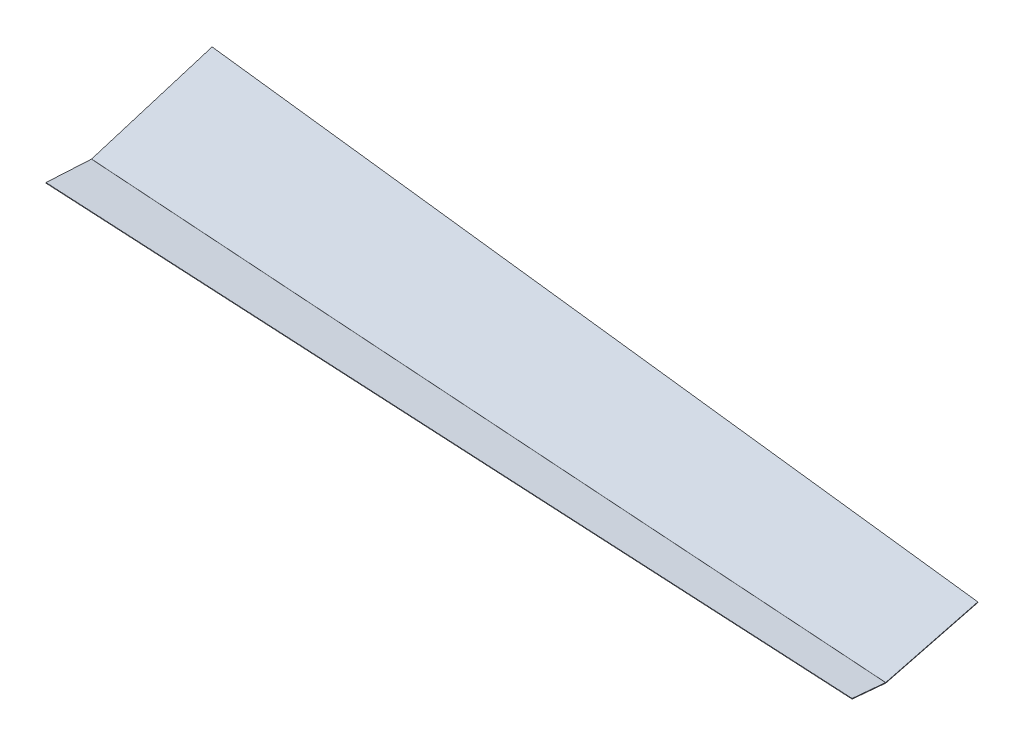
ISO-10303-21;
HEADER;
FILE_DESCRIPTION(('STEP AP214'),'2;1');
FILE_NAME('part.step','',(''),(''),'','','');
FILE_SCHEMA(('AUTOMOTIVE_DESIGN { 1 0 10303 214 1 1 1 1 }'));
ENDSEC;
DATA;
#1=APPLICATION_CONTEXT('core data for automotive mechanical design processes');
#2=APPLICATION_PROTOCOL_DEFINITION('international standard','automotive_design',2000,#1);
#3=PRODUCT_CONTEXT('',#1,'mechanical');
#4=PRODUCT('Part','Part','',(#3));
#5=PRODUCT_RELATED_PRODUCT_CATEGORY('part','',(#4));
#6=PRODUCT_DEFINITION_FORMATION('','',#4);
#7=PRODUCT_DEFINITION_CONTEXT('part definition',#1,'design');
#8=PRODUCT_DEFINITION('design','',#6,#7);
#9=PRODUCT_DEFINITION_SHAPE('','',#8);
#10=(LENGTH_UNIT() NAMED_UNIT(*) SI_UNIT(.MILLI.,.METRE.));
#11=(NAMED_UNIT(*) PLANE_ANGLE_UNIT() SI_UNIT($,.RADIAN.));
#12=(NAMED_UNIT(*) SI_UNIT($,.STERADIAN.) SOLID_ANGLE_UNIT());
#13=UNCERTAINTY_MEASURE_WITH_UNIT(LENGTH_MEASURE(1.E-05),#10,'distance_accuracy_value','');
#14=(GEOMETRIC_REPRESENTATION_CONTEXT(3) GLOBAL_UNCERTAINTY_ASSIGNED_CONTEXT((#13)) GLOBAL_UNIT_ASSIGNED_CONTEXT((#10,
#11,#12)) REPRESENTATION_CONTEXT('',''));
#15=CARTESIAN_POINT('',(0.,0.,0.));
#16=DIRECTION('',(0.,0.,1.));
#17=DIRECTION('',(1.,0.,0.));
#18=AXIS2_PLACEMENT_3D('',#15,#16,#17);
#19=CARTESIAN_POINT('',(78.2546476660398,-374.797848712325,-112.025459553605));
#20=DIRECTION('',(0.998748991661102,0.0206573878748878,0.0455381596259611));
#21=DIRECTION('',(0.0374881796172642,0.293352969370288,-0.955268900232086));
#22=AXIS2_PLACEMENT_3D('',#19,#20,#21);
#23=PLANE('',#22);
#24=DIRECTION('',(-0.0330921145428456,0.955780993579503,0.292211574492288));
#25=VECTOR('',#24,1.);
#26=CARTESIAN_POINT('',(108.26510912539,-139.959612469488,-876.748121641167));
#27=LINE('',#26,#25);
#28=CARTESIAN_POINT('',(108.318903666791,-141.513330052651,-877.223140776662));
#29=VERTEX_POINT('',#28);
#30=CARTESIAN_POINT('',(108.26510912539,-139.959612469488,-876.748121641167));
#31=VERTEX_POINT('',#30);
#32=EDGE_CURVE('E12',#29,#31,#27,.T.);
#33=ORIENTED_EDGE('',*,*,#32,.F.);
#34=DIRECTION('',(0.0374881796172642,0.293352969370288,-0.955268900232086));
#35=VECTOR('',#34,1.);
#36=CARTESIAN_POINT('',(78.3084422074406,-376.351566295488,-112.5004786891));
#37=LINE('',#36,#35);
#38=CARTESIAN_POINT('',(119.079163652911,-57.3120097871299,-1151.41468136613));
#39=VERTEX_POINT('',#38);
#40=EDGE_CURVE('E165',#29,#39,#37,.T.);
#41=ORIENTED_EDGE('',*,*,#40,.T.);
#42=DIRECTION('',(-0.0330921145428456,0.955780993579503,0.292211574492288));
#43=VECTOR('',#42,1.);
#44=CARTESIAN_POINT('',(119.02536911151,-55.7582922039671,-1150.93966223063));
#45=LINE('',#44,#43);
#46=CARTESIAN_POINT('',(119.02536911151,-55.7582922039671,-1150.93966223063));
#47=VERTEX_POINT('',#46);
#48=EDGE_CURVE('E125',#39,#47,#45,.T.);
#49=ORIENTED_EDGE('',*,*,#48,.T.);
#50=DIRECTION('',(0.0374881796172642,0.293352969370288,-0.955268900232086));
#51=VECTOR('',#50,1.);
#52=CARTESIAN_POINT('',(78.2546476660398,-374.797848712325,-112.025459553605));
#53=LINE('',#52,#51);
#54=EDGE_CURVE('E168',#31,#47,#53,.T.);
#55=ORIENTED_EDGE('',*,*,#54,.F.);
#56=EDGE_LOOP('',(#33,#41,#49,#55));
#57=FACE_BOUND('',#56,.T.);
#58=ADVANCED_FACE('F112',(#57),#23,.T.);
#59=CARTESIAN_POINT('',(144.297455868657,-55.758265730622,-1148.07775818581));
#60=DIRECTION('',(-0.107548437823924,-0.294079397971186,0.949710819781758));
#61=DIRECTION('',(0.993648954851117,1.0408800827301E-06,0.112524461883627));
#62=AXIS2_PLACEMENT_3D('',#59,#60,#61);
#63=PLANE('',#62);
#64=ORIENTED_EDGE('',*,*,#48,.F.);
#65=DIRECTION('',(0.993648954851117,1.0408800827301E-06,0.112524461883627));
#66=VECTOR('',#65,1.);
#67=CARTESIAN_POINT('',(144.351250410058,-57.3119833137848,-1148.5527773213));
#68=LINE('',#67,#66);
#69=CARTESIAN_POINT('',(-2552.6462054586,-57.3148085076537,-1453.97068768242));
#70=VERTEX_POINT('',#69);
#71=EDGE_CURVE('E194',#70,#39,#68,.T.);
#72=ORIENTED_EDGE('',*,*,#71,.F.);
#73=DIRECTION('',(-0.0330921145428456,0.955780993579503,0.292211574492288));
#74=VECTOR('',#73,1.);
#75=CARTESIAN_POINT('',(-2552.7,-55.7610909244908,-1453.49566854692));
#76=LINE('',#75,#74);
#77=CARTESIAN_POINT('',(-2552.7,-55.7610909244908,-1453.49566854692));
#78=VERTEX_POINT('',#77);
#79=EDGE_CURVE('E219',#70,#78,#76,.T.);
#80=ORIENTED_EDGE('',*,*,#79,.T.);
#81=DIRECTION('',(0.993648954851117,1.0408800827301E-06,0.112524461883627));
#82=VECTOR('',#81,1.);
#83=CARTESIAN_POINT('',(144.297455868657,-55.758265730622,-1148.07775818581));
#84=LINE('',#83,#82);
#85=EDGE_CURVE('E232',#78,#47,#84,.T.);
#86=ORIENTED_EDGE('',*,*,#85,.T.);
#87=EDGE_LOOP('',(#64,#72,#80,#86));
#88=FACE_BOUND('',#87,.T.);
#89=ADVANCED_FACE('F239',(#88),#63,.F.);
#90=CARTESIAN_POINT('',(-2552.7,-457.38679673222,-139.837177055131));
#91=DIRECTION('',(0.999452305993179,0.0316461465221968,0.00967519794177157));
#92=DIRECTION('',(0.,0.292371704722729,-0.956304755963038));
#93=AXIS2_PLACEMENT_3D('',#90,#91,#92);
#94=PLANE('',#93);
#95=ORIENTED_EDGE('',*,*,#79,.F.);
#96=DIRECTION('',(0.,-0.292371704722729,0.956304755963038));
#97=VECTOR('',#96,1.);
#98=CARTESIAN_POINT('',(-2552.6462054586,-458.940514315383,-140.312196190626));
#99=LINE('',#98,#97);
#100=CARTESIAN_POINT('',(-2552.6462054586,-171.288577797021,-1081.17928596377));
#101=VERTEX_POINT('',#100);
#102=EDGE_CURVE('E282',#101,#70,#99,.F.);
#103=ORIENTED_EDGE('',*,*,#102,.F.);
#104=DIRECTION('',(-0.0330921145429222,0.955780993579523,0.292211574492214));
#105=VECTOR('',#104,1.);
#106=CARTESIAN_POINT('',(-2552.7,-169.734860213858,-1080.70426682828));
#107=LINE('',#106,#105);
#108=CARTESIAN_POINT('',(-2552.7,-169.734860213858,-1080.70426682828));
#109=VERTEX_POINT('',#108);
#110=EDGE_CURVE('E215',#101,#109,#107,.T.);
#111=ORIENTED_EDGE('',*,*,#110,.T.);
#112=DIRECTION('',(0.,0.292371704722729,-0.956304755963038));
#113=VECTOR('',#112,1.);
#114=CARTESIAN_POINT('',(-2552.7,-457.38679673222,-139.837177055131));
#115=LINE('',#114,#113);
#116=EDGE_CURVE('E241',#109,#78,#115,.T.);
#117=ORIENTED_EDGE('',*,*,#116,.T.);
#118=EDGE_LOOP('',(#95,#103,#111,#117));
#119=FACE_BOUND('',#118,.T.);
#120=ADVANCED_FACE('F289',(#119),#94,.F.);
#121=CARTESIAN_POINT('',(-2552.57445724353,-168.650202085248,-1083.4422371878));
#122=CARTESIAN_POINT('',(-2552.61630482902,-168.572159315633,-1082.90765549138));
#123=CARTESIAN_POINT('',(-2552.65815241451,-168.494116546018,-1082.37307379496));
#124=CARTESIAN_POINT('',(-2552.7,-168.416073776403,-1081.83849209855));
#125=CARTESIAN_POINT('',(-2552.57445724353,-175.084398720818,-1082.50291859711));
#126=CARTESIAN_POINT('',(-2552.61630482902,-173.933989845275,-1082.12488999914));
#127=CARTESIAN_POINT('',(-2552.65815241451,-172.783580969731,-1081.74686140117));
#128=CARTESIAN_POINT('',(-2552.7,-171.633172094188,-1081.3688328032));
#129=CARTESIAN_POINT('',(-2552.82554275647,-174.145075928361,-1076.06869318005));
#130=CARTESIAN_POINT('',(-2552.78369517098,-173.150752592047,-1076.75982797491));
#131=CARTESIAN_POINT('',(-2552.74184758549,-172.156429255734,-1077.45096276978));
#132=CARTESIAN_POINT('',(-2552.7,-171.162105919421,-1078.14209756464));
#133=CARTESIAN_POINT('',(-2552.82554275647,-167.71087929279,-1077.00801177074));
#134=CARTESIAN_POINT('',(-2552.78369517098,-167.788922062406,-1077.54259346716));
#135=CARTESIAN_POINT('',(-2552.74184758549,-167.866964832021,-1078.07717516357));
#136=CARTESIAN_POINT('',(-2552.7,-167.945007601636,-1078.61175685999));
#137=CARTESIAN_POINT('',(-2552.82554275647,-161.27668265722,-1077.94733036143));
#138=CARTESIAN_POINT('',(-2552.78369517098,-162.427091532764,-1078.3253589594));
#139=CARTESIAN_POINT('',(-2552.74184758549,-163.577500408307,-1078.70338755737));
#140=CARTESIAN_POINT('',(-2552.7,-164.727909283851,-1079.08141615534));
#141=CARTESIAN_POINT('',(-2552.57445724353,-162.216005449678,-1084.38155577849));
#142=CARTESIAN_POINT('',(-2552.61630482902,-163.210328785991,-1083.69042098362));
#143=CARTESIAN_POINT('',(-2552.65815241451,-164.204652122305,-1082.99928618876));
#144=CARTESIAN_POINT('',(-2552.7,-165.198975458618,-1082.30815139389));
#145=CARTESIAN_POINT('',(-2552.57445724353,-168.650202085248,-1083.4422371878));
#146=CARTESIAN_POINT('',(-2552.61630482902,-168.572159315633,-1082.90765549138));
#147=CARTESIAN_POINT('',(-2552.65815241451,-168.494116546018,-1082.37307379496));
#148=CARTESIAN_POINT('',(-2552.7,-168.416073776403,-1081.83849209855));
#149=(BOUNDED_SURFACE() B_SPLINE_SURFACE(3,3,((#121,#122,#123,#124),(#125,#126,#127,#128),(#129,
#130,#131,#132),(#133,#134,#135,#136),(#137,#138,#139,#140),(#141,#142,#143,#144),(#145,#146,
#147,#148)),.UNSPECIFIED.,.T.,.F.,.F.) B_SPLINE_SURFACE_WITH_KNOTS((4,3,4),(4,4),(0.,0.5,1.),
(0.,1.),.UNSPECIFIED.) GEOMETRIC_REPRESENTATION_ITEM() RATIONAL_B_SPLINE_SURFACE(((1.,1.,1.,1.),
(0.333333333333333,0.333333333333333,0.333333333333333,0.333333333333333),(0.333333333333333,
0.333333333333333,0.333333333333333,0.333333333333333),(1.,1.,1.,1.),(0.333333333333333,
0.333333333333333,0.333333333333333,0.333333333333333),(0.333333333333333,0.333333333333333,
0.333333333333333,0.333333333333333),(1.,1.,1.,1.))) REPRESENTATION_ITEM('') SURFACE());
#150=CARTESIAN_POINT('',(-2552.7,-168.180540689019,-1080.22512447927));
#151=DIRECTION('',(0.999255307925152,0.00557393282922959,0.0381806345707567));
#152=DIRECTION('',(0.0385853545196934,-0.144349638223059,-0.98877416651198));
#153=AXIS2_PLACEMENT_3D('',#150,#151,#152);
#154=ELLIPSE('',#153,3.25363750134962,3.2512);
#155=CARTESIAN_POINT('',(-2552.68850703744,-171.427125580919,-1080.05195181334));
#156=VERTEX_POINT('',#155);
#157=EDGE_CURVE('E183',#101,#156,#154,.F.);
#158=DIRECTION('',(-0.0070699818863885,0.998540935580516,-0.0535351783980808));
#159=VECTOR('',#158,1.);
#160=CARTESIAN_POINT('',(-2552.7,-169.803897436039,-1080.13897859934));
#161=LINE('',#160,#159);
#162=CARTESIAN_POINT('',(-2552.7,-169.803897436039,-1080.13897859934));
#163=VERTEX_POINT('',#162);
#164=EDGE_CURVE('E133',#156,#163,#161,.T.);
#165=CARTESIAN_POINT('',(-2552.7,-168.180540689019,-1080.22512447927));
#166=DIRECTION('',(1.,0.,0.));
#167=DIRECTION('',(0.,-0.144457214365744,-0.989511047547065));
#168=AXIS2_PLACEMENT_3D('',#165,#166,#167);
#169=ELLIPSE('',#168,1.63046953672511,1.6256);
#170=EDGE_CURVE('E237',#109,#163,#169,.F.);
#171=ORIENTED_EDGE('',*,*,#110,.F.);
#172=ORIENTED_EDGE('',*,*,#157,.T.);
#173=ORIENTED_EDGE('',*,*,#164,.T.);
#174=ORIENTED_EDGE('',*,*,#170,.F.);
#175=EDGE_LOOP('',(#171,#172,#173,#174));
#176=FACE_BOUND('',#175,.T.);
#177=ADVANCED_FACE('F292',(#176),#149,.T.);
#178=CARTESIAN_POINT('',(-2552.7,-111.573264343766,5.98182247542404));
#179=DIRECTION('',(0.999975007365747,0.00705984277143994,-0.00037850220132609));
#180=DIRECTION('',(0.,-0.0535365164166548,-0.998565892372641));
#181=AXIS2_PLACEMENT_3D('',#178,#179,#180);
#182=PLANE('',#181);
#183=ORIENTED_EDGE('',*,*,#164,.F.);
#184=DIRECTION('',(0.,0.0535365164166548,0.998565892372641));
#185=VECTOR('',#184,1.);
#186=CARTESIAN_POINT('',(-2552.68850703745,-113.196492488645,6.06884926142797));
#187=LINE('',#186,#185);
#188=CARTESIAN_POINT('',(-2552.68850703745,-163.895730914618,-939.575986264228));
#189=VERTEX_POINT('',#188);
#190=EDGE_CURVE('E189',#189,#156,#187,.F.);
#191=ORIENTED_EDGE('',*,*,#190,.F.);
#192=DIRECTION('',(-0.0070699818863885,0.998540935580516,-0.0535351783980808));
#193=VECTOR('',#192,1.);
#194=CARTESIAN_POINT('',(-2552.7,-162.272502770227,-939.663013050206));
#195=LINE('',#194,#193);
#196=CARTESIAN_POINT('',(-2552.7,-162.272502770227,-939.663013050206));
#197=VERTEX_POINT('',#196);
#198=EDGE_CURVE('E209',#189,#197,#195,.T.);
#199=ORIENTED_EDGE('',*,*,#198,.T.);
#200=DIRECTION('',(0.,-0.0535365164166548,-0.998565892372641));
#201=VECTOR('',#200,1.);
#202=CARTESIAN_POINT('',(-2552.7,-111.573264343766,5.98182247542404));
#203=LINE('',#202,#201);
#204=EDGE_CURVE('E258',#197,#163,#203,.T.);
#205=ORIENTED_EDGE('',*,*,#204,.T.);
#206=EDGE_LOOP('',(#183,#191,#199,#205));
#207=FACE_BOUND('',#206,.T.);
#208=ADVANCED_FACE('F316',(#207),#182,.F.);
#209=CARTESIAN_POINT('',(-2578.06249982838,-162.535472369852,-941.218504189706));
#210=DIRECTION('',(-0.0616767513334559,0.0529991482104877,0.996688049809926));
#211=DIRECTION('',(0.998071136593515,0.0103484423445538,0.061212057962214));
#212=AXIS2_PLACEMENT_3D('',#209,#210,#211);
#213=PLANE('',#212);
#214=ORIENTED_EDGE('',*,*,#198,.F.);
#215=DIRECTION('',(0.998071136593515,0.0103484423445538,0.061212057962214));
#216=VECTOR('',#215,1.);
#217=CARTESIAN_POINT('',(-2578.05100686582,-164.158700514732,-941.131477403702));
#218=LINE('',#217,#216);
#219=CARTESIAN_POINT('',(104.350584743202,-136.346376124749,-776.618833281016));
#220=VERTEX_POINT('',#219);
#221=EDGE_CURVE('E278',#189,#220,#218,.T.);
#222=ORIENTED_EDGE('',*,*,#221,.T.);
#223=DIRECTION('',(-0.0070699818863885,0.998540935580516,-0.0535351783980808));
#224=VECTOR('',#223,1.);
#225=CARTESIAN_POINT('',(104.339091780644,-134.723147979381,-776.705860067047));
#226=LINE('',#225,#224);
#227=CARTESIAN_POINT('',(104.339091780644,-134.723147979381,-776.705860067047));
#228=VERTEX_POINT('',#227);
#229=EDGE_CURVE('E205',#220,#228,#226,.T.);
#230=ORIENTED_EDGE('',*,*,#229,.T.);
#231=DIRECTION('',(0.998071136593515,0.0103484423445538,0.061212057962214));
#232=VECTOR('',#231,1.);
#233=CARTESIAN_POINT('',(-2578.06249982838,-162.535472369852,-941.218504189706));
#234=LINE('',#233,#232);
#235=EDGE_CURVE('E244',#197,#228,#234,.T.);
#236=ORIENTED_EDGE('',*,*,#235,.F.);
#237=EDGE_LOOP('',(#214,#222,#230,#236));
#238=FACE_BOUND('',#237,.T.);
#239=ADVANCED_FACE('F302',(#238),#213,.T.);
#240=CARTESIAN_POINT('',(73.5506912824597,-92.8789578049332,7.84014307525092));
#241=DIRECTION('',(0.999208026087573,0.00915085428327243,0.038724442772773));
#242=DIRECTION('',(0.0391578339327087,-0.0532189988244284,-0.997814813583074));
#243=AXIS2_PLACEMENT_3D('',#240,#241,#242);
#244=PLANE('',#243);
#245=ORIENTED_EDGE('',*,*,#229,.F.);
#246=DIRECTION('',(0.0391578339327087,-0.0532189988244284,-0.997814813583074));
#247=VECTOR('',#246,1.);
#248=CARTESIAN_POINT('',(73.5621842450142,-94.5021859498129,7.92716986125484));
#249=LINE('',#248,#247);
#250=CARTESIAN_POINT('',(108.254484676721,-141.652125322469,-876.097501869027));
#251=VERTEX_POINT('',#250);
#252=EDGE_CURVE('E275',#220,#251,#249,.T.);
#253=ORIENTED_EDGE('',*,*,#252,.T.);
#254=DIRECTION('',(-0.00706998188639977,0.998540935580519,-0.0535351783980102));
#255=VECTOR('',#254,1.);
#256=CARTESIAN_POINT('',(108.242991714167,-140.028897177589,-876.184528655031));
#257=LINE('',#256,#255);
#258=CARTESIAN_POINT('',(108.242991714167,-140.028897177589,-876.184528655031));
#259=VERTEX_POINT('',#258);
#260=EDGE_CURVE('E118',#251,#259,#257,.T.);
#261=ORIENTED_EDGE('',*,*,#260,.T.);
#262=DIRECTION('',(0.0391578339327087,-0.0532189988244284,-0.997814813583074));
#263=VECTOR('',#262,1.);
#264=CARTESIAN_POINT('',(73.5506912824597,-92.8789578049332,7.84014307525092));
#265=LINE('',#264,#263);
#266=EDGE_CURVE('E252',#228,#259,#265,.T.);
#267=ORIENTED_EDGE('',*,*,#266,.F.);
#268=EDGE_LOOP('',(#245,#253,#261,#267));
#269=FACE_BOUND('',#268,.T.);
#270=ADVANCED_FACE('F310',(#269),#244,.T.);
#271=CARTESIAN_POINT('',(108.431680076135,-139.337979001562,-879.38015107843));
#272=CARTESIAN_POINT('',(108.390278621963,-139.18268394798,-878.86266788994));
#273=CARTESIAN_POINT('',(108.348877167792,-139.027388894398,-878.34518470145));
#274=CARTESIAN_POINT('',(108.30747571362,-138.872093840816,-877.82770151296));
#275=CARTESIAN_POINT('',(108.50481119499,-133.108760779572,-881.243668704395));
#276=CARTESIAN_POINT('',(108.45122122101,-133.991668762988,-880.415599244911));
#277=CARTESIAN_POINT('',(108.397631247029,-134.874576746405,-879.587529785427));
#278=CARTESIAN_POINT('',(108.344041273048,-135.757484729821,-878.759460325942));
#279=CARTESIAN_POINT('',(108.134175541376,-131.243808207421,-875.024198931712));
#280=CARTESIAN_POINT('',(108.163388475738,-132.437306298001,-875.231095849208));
#281=CARTESIAN_POINT('',(108.192601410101,-133.630804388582,-875.437992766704));
#282=CARTESIAN_POINT('',(108.221814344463,-134.824302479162,-875.6448896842));
#283=CARTESIAN_POINT('',(108.06104442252,-137.473026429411,-873.160681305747));
#284=CARTESIAN_POINT('',(108.102445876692,-137.628321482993,-873.678164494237));
#285=CARTESIAN_POINT('',(108.143847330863,-137.783616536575,-874.195647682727));
#286=CARTESIAN_POINT('',(108.185248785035,-137.938911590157,-874.713130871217));
#287=CARTESIAN_POINT('',(107.987913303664,-143.702244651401,-871.297163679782));
#288=CARTESIAN_POINT('',(108.041503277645,-142.819336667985,-872.125233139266));
#289=CARTESIAN_POINT('',(108.095093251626,-141.936428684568,-872.953302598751));
#290=CARTESIAN_POINT('',(108.148683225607,-141.053520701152,-873.781372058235));
#291=CARTESIAN_POINT('',(108.358548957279,-145.567197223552,-877.516633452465));
#292=CARTESIAN_POINT('',(108.329336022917,-144.373699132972,-877.309736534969));
#293=CARTESIAN_POINT('',(108.300123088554,-143.180201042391,-877.102839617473));
#294=CARTESIAN_POINT('',(108.270910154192,-141.986702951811,-876.895942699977));
#295=CARTESIAN_POINT('',(108.431680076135,-139.337979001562,-879.38015107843));
#296=CARTESIAN_POINT('',(108.390278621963,-139.18268394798,-878.86266788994));
#297=CARTESIAN_POINT('',(108.348877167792,-139.027388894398,-878.34518470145));
#298=CARTESIAN_POINT('',(108.30747571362,-138.872093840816,-877.82770151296));
#299=(BOUNDED_SURFACE() B_SPLINE_SURFACE(3,3,((#271,#272,#273,#274),(#275,#276,#277,#278),(#279,
#280,#281,#282),(#283,#284,#285,#286),(#287,#288,#289,#290),(#291,#292,#293,#294),(#295,#296,
#297,#298)),.UNSPECIFIED.,.T.,.F.,.F.) B_SPLINE_SURFACE_WITH_KNOTS((4,3,4),(4,4),(0.,0.5,1.),
(0.,1.),.UNSPECIFIED.) GEOMETRIC_REPRESENTATION_ITEM() RATIONAL_B_SPLINE_SURFACE(((1.,1.,1.,1.),
(0.333333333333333,0.333333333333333,0.333333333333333,0.333333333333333),(0.333333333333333,
0.333333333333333,0.333333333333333,0.333333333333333),(1.,1.,1.,1.),(0.333333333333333,
0.333333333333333,0.333333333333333,0.333333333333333),(0.333333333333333,0.333333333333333,
0.333333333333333,0.333333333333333),(1.,1.,1.,1.))) REPRESENTATION_ITEM('') SURFACE());
#300=CARTESIAN_POINT('',(108.246362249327,-138.405502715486,-876.270416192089));
#301=DIRECTION('',(-0.99831145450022,-0.0055770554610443,-0.0578198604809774));
#302=DIRECTION('',(0.0569890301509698,-0.286755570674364,-0.956307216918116));
#303=AXIS2_PLACEMENT_3D('',#300,#301,#302);
#304=ELLIPSE('',#303,3.25181576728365,3.2512);
#305=EDGE_CURVE('E181',#251,#29,#304,.F.);
#306=CARTESIAN_POINT('',(108.246362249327,-138.405502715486,-876.270416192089));
#307=DIRECTION('',(-0.999230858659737,0.,-0.0392134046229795));
#308=DIRECTION('',(0.037565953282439,-0.286809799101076,-0.957250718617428));
#309=AXIS2_PLACEMENT_3D('',#306,#307,#308);
#310=ELLIPSE('',#309,1.62683118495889,1.6256);
#311=EDGE_CURVE('E268',#259,#31,#310,.F.);
#312=ORIENTED_EDGE('',*,*,#305,.T.);
#313=ORIENTED_EDGE('',*,*,#32,.T.);
#314=ORIENTED_EDGE('',*,*,#311,.F.);
#315=ORIENTED_EDGE('',*,*,#260,.F.);
#316=EDGE_LOOP('',(#312,#313,#314,#315));
#317=FACE_BOUND('',#316,.T.);
#318=ADVANCED_FACE('F114',(#317),#299,.T.);
#319=CARTESIAN_POINT('',(0.662338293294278,-93.5464771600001,5.01534505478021));
#320=DIRECTION('',(-0.0070699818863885,0.998540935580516,-0.0535351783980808));
#321=DIRECTION('',(0.,0.0535365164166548,0.998565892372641));
#322=AXIS2_PLACEMENT_3D('',#319,#320,#321);
#323=PLANE('',#322);
#324=ORIENTED_EDGE('',*,*,#266,.T.);
#325=DIRECTION('',(0.997013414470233,0.0111562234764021,0.0764185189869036));
#326=VECTOR('',#325,1.);
#327=CARTESIAN_POINT('',(-2552.72217814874,-169.80414560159,-1080.14067849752));
#328=LINE('',#327,#326);
#329=EDGE_CURVE('E264',#259,#163,#328,.F.);
#330=ORIENTED_EDGE('',*,*,#329,.T.);
#331=ORIENTED_EDGE('',*,*,#204,.F.);
#332=ORIENTED_EDGE('',*,*,#235,.T.);
#333=EDGE_LOOP('',(#324,#330,#331,#332));
#334=FACE_BOUND('',#333,.T.);
#335=ADVANCED_FACE('F309',(#334),#323,.T.);
#336=CARTESIAN_POINT('',(13.0233820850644,-376.147044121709,-114.999692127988));
#337=DIRECTION('',(-0.0330921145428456,0.955780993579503,0.292211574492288));
#338=DIRECTION('',(0.,-0.292371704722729,0.956304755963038));
#339=AXIS2_PLACEMENT_3D('',#336,#337,#338);
#340=PLANE('',#339);
#341=ORIENTED_EDGE('',*,*,#116,.F.);
#342=DIRECTION('',(0.997013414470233,0.0111562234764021,0.0764185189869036));
#343=VECTOR('',#342,1.);
#344=CARTESIAN_POINT('',(108.274415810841,-139.959508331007,-876.747408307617));
#345=LINE('',#344,#343);
#346=EDGE_CURVE('E235',#109,#31,#345,.T.);
#347=ORIENTED_EDGE('',*,*,#346,.T.);
#348=ORIENTED_EDGE('',*,*,#54,.T.);
#349=ORIENTED_EDGE('',*,*,#85,.F.);
#350=EDGE_LOOP('',(#341,#347,#348,#349));
#351=FACE_BOUND('',#350,.T.);
#352=ADVANCED_FACE('F231',(#351),#340,.T.);
#353=CARTESIAN_POINT('',(68.9483755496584,-138.845233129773,-879.282505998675));
#354=DIRECTION('',(-0.997013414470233,-0.0111562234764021,-0.0764185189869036));
#355=DIRECTION('',(-0.0764232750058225,0.,0.997075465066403));
#356=AXIS2_PLACEMENT_3D('',#353,#354,#355);
#357=CYLINDRICAL_SURFACE('',#356,1.6256);
#358=ORIENTED_EDGE('',*,*,#170,.T.);
#359=ORIENTED_EDGE('',*,*,#329,.F.);
#360=ORIENTED_EDGE('',*,*,#311,.T.);
#361=ORIENTED_EDGE('',*,*,#346,.F.);
#362=EDGE_LOOP('',(#358,#359,#360,#361));
#363=FACE_BOUND('',#362,.T.);
#364=ADVANCED_FACE('F295',(#363),#357,.F.);
#365=CARTESIAN_POINT('',(0.673831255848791,-95.1697053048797,5.10237184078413));
#366=DIRECTION('',(-0.0070699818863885,0.998540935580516,-0.0535351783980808));
#367=DIRECTION('',(0.,0.0535365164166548,0.998565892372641));
#368=AXIS2_PLACEMENT_3D('',#365,#366,#367);
#369=PLANE('',#368);
#370=ORIENTED_EDGE('',*,*,#252,.F.);
#371=ORIENTED_EDGE('',*,*,#221,.F.);
#372=ORIENTED_EDGE('',*,*,#190,.T.);
#373=DIRECTION('',(-0.997013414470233,-0.0111562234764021,-0.0764185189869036));
#374=VECTOR('',#373,1.);
#375=CARTESIAN_POINT('',(68.9713614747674,-142.091689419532,-879.108452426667));
#376=LINE('',#375,#374);
#377=EDGE_CURVE('E188',#251,#156,#376,.T.);
#378=ORIENTED_EDGE('',*,*,#377,.F.);
#379=EDGE_LOOP('',(#370,#371,#372,#378));
#380=FACE_BOUND('',#379,.T.);
#381=ADVANCED_FACE('F313',(#380),#369,.F.);
#382=CARTESIAN_POINT('',(13.0771766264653,-377.700761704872,-115.474711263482));
#383=DIRECTION('',(-0.0330921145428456,0.955780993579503,0.292211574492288));
#384=DIRECTION('',(0.,-0.292371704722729,0.956304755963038));
#385=AXIS2_PLACEMENT_3D('',#382,#383,#384);
#386=PLANE('',#385);
#387=ORIENTED_EDGE('',*,*,#102,.T.);
#388=ORIENTED_EDGE('',*,*,#71,.T.);
#389=ORIENTED_EDGE('',*,*,#40,.F.);
#390=DIRECTION('',(-0.997013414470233,-0.0111562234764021,-0.0764185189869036));
#391=VECTOR('',#390,1.);
#392=CARTESIAN_POINT('',(69.0559646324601,-141.952668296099,-880.232544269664));
#393=LINE('',#392,#391);
#394=EDGE_CURVE('E178',#101,#29,#393,.F.);
#395=ORIENTED_EDGE('',*,*,#394,.F.);
#396=EDGE_LOOP('',(#387,#388,#389,#395));
#397=FACE_BOUND('',#396,.T.);
#398=ADVANCED_FACE('F192',(#397),#386,.F.);
#399=CARTESIAN_POINT('',(68.9483755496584,-138.845233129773,-879.282505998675));
#400=DIRECTION('',(-0.997013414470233,-0.0111562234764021,-0.0764185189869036));
#401=DIRECTION('',(-0.0764232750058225,0.,0.997075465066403));
#402=AXIS2_PLACEMENT_3D('',#399,#400,#401);
#403=CYLINDRICAL_SURFACE('',#402,3.2512);
#404=ORIENTED_EDGE('',*,*,#157,.F.);
#405=ORIENTED_EDGE('',*,*,#394,.T.);
#406=ORIENTED_EDGE('',*,*,#305,.F.);
#407=ORIENTED_EDGE('',*,*,#377,.T.);
#408=EDGE_LOOP('',(#404,#405,#406,#407));
#409=FACE_BOUND('',#408,.T.);
#410=ADVANCED_FACE('F179',(#409),#403,.T.);
#411=CLOSED_SHELL('',(#58,#89,#120,#177,#208,#239,#270,#318,#335,#352,#364,#381,#398,#410));
#412=MANIFOLD_SOLID_BREP('B2',#411);
#413=ADVANCED_BREP_SHAPE_REPRESENTATION('',(#18,#412),#14);
#414=SHAPE_DEFINITION_REPRESENTATION(#9,#413);
ENDSEC;
END-ISO-10303-21;
